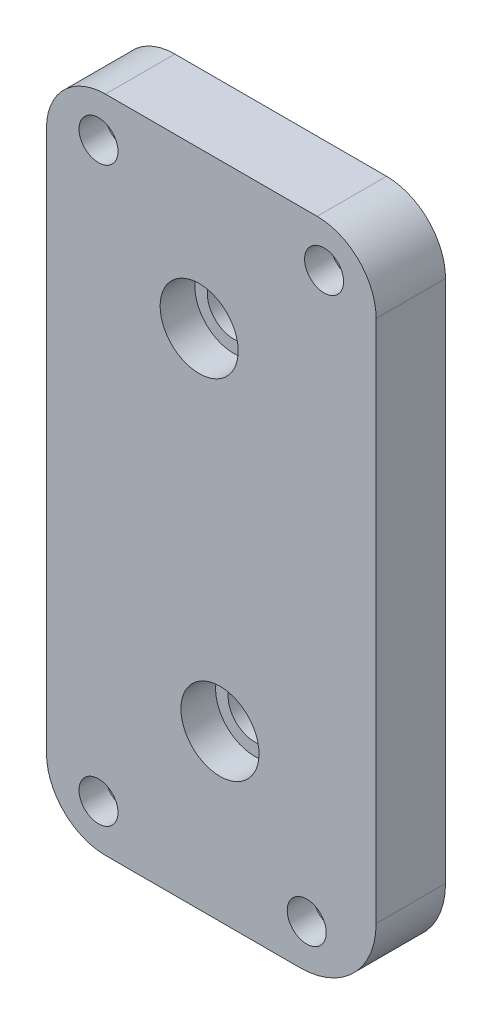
ISO-10303-21;
HEADER;
FILE_DESCRIPTION(('STEP AP214'),'2;1');
FILE_NAME('part.step','',(''),(''),'','','');
FILE_SCHEMA(('AUTOMOTIVE_DESIGN { 1 0 10303 214 1 1 1 1 }'));
ENDSEC;
DATA;
#1=APPLICATION_CONTEXT('core data for automotive mechanical design processes');
#2=APPLICATION_PROTOCOL_DEFINITION('international standard','automotive_design',2000,#1);
#3=PRODUCT_CONTEXT('',#1,'mechanical');
#4=PRODUCT('Part','Part','',(#3));
#5=PRODUCT_RELATED_PRODUCT_CATEGORY('part','',(#4));
#6=PRODUCT_DEFINITION_FORMATION('','',#4);
#7=PRODUCT_DEFINITION_CONTEXT('part definition',#1,'design');
#8=PRODUCT_DEFINITION('design','',#6,#7);
#9=PRODUCT_DEFINITION_SHAPE('','',#8);
#10=(LENGTH_UNIT() NAMED_UNIT(*) SI_UNIT(.MILLI.,.METRE.));
#11=(NAMED_UNIT(*) PLANE_ANGLE_UNIT() SI_UNIT($,.RADIAN.));
#12=(NAMED_UNIT(*) SI_UNIT($,.STERADIAN.) SOLID_ANGLE_UNIT());
#13=UNCERTAINTY_MEASURE_WITH_UNIT(LENGTH_MEASURE(1.E-05),#10,'distance_accuracy_value','');
#14=(GEOMETRIC_REPRESENTATION_CONTEXT(3) GLOBAL_UNCERTAINTY_ASSIGNED_CONTEXT((#13)) GLOBAL_UNIT_ASSIGNED_CONTEXT((#10,
#11,#12)) REPRESENTATION_CONTEXT('',''));
#15=CARTESIAN_POINT('',(0.,0.,0.));
#16=DIRECTION('',(0.,0.,1.));
#17=DIRECTION('',(1.,0.,0.));
#18=AXIS2_PLACEMENT_3D('',#15,#16,#17);
#19=CARTESIAN_POINT('',(-112.395,93.6752,12.7));
#20=DIRECTION('',(0.,0.,-1.));
#21=DIRECTION('',(-1.,0.,0.));
#22=AXIS2_PLACEMENT_3D('',#19,#20,#21);
#23=PLANE('',#22);
#24=CARTESIAN_POINT('',(-152.4,-8.24229999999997,12.7));
#25=DIRECTION('',(0.,0.,-1.));
#26=DIRECTION('',(-1.,0.,0.));
#27=AXIS2_PLACEMENT_3D('',#24,#25,#26);
#28=CIRCLE('',#27,3.56870000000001);
#29=CARTESIAN_POINT('',(-155.9687,-8.24229999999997,12.7));
#30=VERTEX_POINT('',#29);
#31=EDGE_CURVE('E358',#30,#30,#28,.T.);
#32=ORIENTED_EDGE('',*,*,#31,.T.);
#33=EDGE_LOOP('',(#32));
#34=FACE_BOUND('',#33,.T.);
#35=CARTESIAN_POINT('',(-111.125,96.5327,12.7));
#36=DIRECTION('',(0.,0.,-1.));
#37=DIRECTION('',(-1.,0.,0.));
#38=AXIS2_PLACEMENT_3D('',#35,#36,#37);
#39=CIRCLE('',#38,3.56869999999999);
#40=CARTESIAN_POINT('',(-114.6937,96.5327,12.7));
#41=VERTEX_POINT('',#40);
#42=EDGE_CURVE('E369',#41,#41,#39,.T.);
#43=ORIENTED_EDGE('',*,*,#42,.T.);
#44=EDGE_LOOP('',(#43));
#45=FACE_BOUND('',#44,.T.);
#46=CARTESIAN_POINT('',(-114.3,-8.24229999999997,12.7));
#47=DIRECTION('',(0.,0.,-1.));
#48=DIRECTION('',(-1.,0.,0.));
#49=AXIS2_PLACEMENT_3D('',#46,#47,#48);
#50=CIRCLE('',#49,3.56869999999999);
#51=CARTESIAN_POINT('',(-117.8687,-8.24229999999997,12.7));
#52=VERTEX_POINT('',#51);
#53=EDGE_CURVE('E379',#52,#52,#50,.T.);
#54=ORIENTED_EDGE('',*,*,#53,.T.);
#55=EDGE_LOOP('',(#54));
#56=FACE_BOUND('',#55,.T.);
#57=CARTESIAN_POINT('',(-152.4,96.5327,12.7));
#58=DIRECTION('',(0.,0.,-1.));
#59=DIRECTION('',(-1.,0.,0.));
#60=AXIS2_PLACEMENT_3D('',#57,#58,#59);
#61=CIRCLE('',#60,3.56870000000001);
#62=CARTESIAN_POINT('',(-155.9687,96.5327,12.7));
#63=VERTEX_POINT('',#62);
#64=EDGE_CURVE('E389',#63,#63,#61,.T.);
#65=ORIENTED_EDGE('',*,*,#64,.T.);
#66=EDGE_LOOP('',(#65));
#67=FACE_BOUND('',#66,.T.);
#68=CARTESIAN_POINT('',(-130.175,13.97,12.7));
#69=DIRECTION('',(0.,0.,-1.));
#70=DIRECTION('',(-1.,0.,0.));
#71=AXIS2_PLACEMENT_3D('',#68,#69,#70);
#72=CIRCLE('',#71,7.14375);
#73=CARTESIAN_POINT('',(-137.31875,13.97,12.7));
#74=VERTEX_POINT('',#73);
#75=EDGE_CURVE('E209',#74,#74,#72,.F.);
#76=ORIENTED_EDGE('',*,*,#75,.F.);
#77=EDGE_LOOP('',(#76));
#78=FACE_BOUND('',#77,.T.);
#79=CARTESIAN_POINT('',(-112.395,93.6752,12.7));
#80=DIRECTION('',(0.,0.,-1.));
#81=DIRECTION('',(-1.,0.,0.));
#82=AXIS2_PLACEMENT_3D('',#79,#80,#81);
#83=CIRCLE('',#82,10.795);
#84=CARTESIAN_POINT('',(-112.395,104.4702,12.7));
#85=VERTEX_POINT('',#84);
#86=CARTESIAN_POINT('',(-101.6,93.6752,12.7));
#87=VERTEX_POINT('',#86);
#88=EDGE_CURVE('E147',#85,#87,#83,.T.);
#89=ORIENTED_EDGE('',*,*,#88,.F.);
#90=DIRECTION('',(1.,0.,0.));
#91=VECTOR('',#90,1.);
#92=CARTESIAN_POINT('',(-151.13,104.4702,12.7));
#93=LINE('',#92,#91);
#94=CARTESIAN_POINT('',(-151.13,104.4702,12.7));
#95=VERTEX_POINT('',#94);
#96=EDGE_CURVE('E166',#95,#85,#93,.T.);
#97=ORIENTED_EDGE('',*,*,#96,.F.);
#98=CARTESIAN_POINT('',(-151.13,93.6752,12.7));
#99=DIRECTION('',(0.,0.,-1.));
#100=DIRECTION('',(-1.,0.,0.));
#101=AXIS2_PLACEMENT_3D('',#98,#99,#100);
#102=CIRCLE('',#101,10.795);
#103=CARTESIAN_POINT('',(-161.925,93.6752,12.7));
#104=VERTEX_POINT('',#103);
#105=EDGE_CURVE('E163',#104,#95,#102,.T.);
#106=ORIENTED_EDGE('',*,*,#105,.F.);
#107=DIRECTION('',(0.,1.,0.));
#108=VECTOR('',#107,1.);
#109=CARTESIAN_POINT('',(-161.925,-5.38479999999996,12.7));
#110=LINE('',#109,#108);
#111=CARTESIAN_POINT('',(-161.925,-5.38479999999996,12.7));
#112=VERTEX_POINT('',#111);
#113=EDGE_CURVE('E114',#112,#104,#110,.T.);
#114=ORIENTED_EDGE('',*,*,#113,.F.);
#115=CARTESIAN_POINT('',(-151.13,-5.38479999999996,12.7));
#116=DIRECTION('',(0.,0.,-1.));
#117=DIRECTION('',(-1.,0.,0.));
#118=AXIS2_PLACEMENT_3D('',#115,#116,#117);
#119=CIRCLE('',#118,10.795);
#120=CARTESIAN_POINT('',(-151.13,-16.1798,12.7));
#121=VERTEX_POINT('',#120);
#122=EDGE_CURVE('E158',#121,#112,#119,.T.);
#123=ORIENTED_EDGE('',*,*,#122,.F.);
#124=DIRECTION('',(-1.,0.,0.));
#125=VECTOR('',#124,1.);
#126=CARTESIAN_POINT('',(-115.57,-16.1798,12.7));
#127=LINE('',#126,#125);
#128=CARTESIAN_POINT('',(-115.57,-16.1798,12.7));
#129=VERTEX_POINT('',#128);
#130=EDGE_CURVE('E155',#129,#121,#127,.T.);
#131=ORIENTED_EDGE('',*,*,#130,.F.);
#132=CARTESIAN_POINT('',(-115.57,-2.20979999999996,12.7));
#133=DIRECTION('',(0.,0.,-1.));
#134=DIRECTION('',(-1.,0.,0.));
#135=AXIS2_PLACEMENT_3D('',#132,#133,#134);
#136=CIRCLE('',#135,13.97);
#137=CARTESIAN_POINT('',(-101.6,-2.20979999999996,12.7));
#138=VERTEX_POINT('',#137);
#139=EDGE_CURVE('E152',#138,#129,#136,.T.);
#140=ORIENTED_EDGE('',*,*,#139,.F.);
#141=DIRECTION('',(0.,-1.,0.));
#142=VECTOR('',#141,1.);
#143=CARTESIAN_POINT('',(-101.6,93.6752,12.7));
#144=LINE('',#143,#142);
#145=EDGE_CURVE('E60',#87,#138,#144,.T.);
#146=ORIENTED_EDGE('',*,*,#145,.F.);
#147=EDGE_LOOP('',(#89,#97,#106,#114,#123,#131,#140,#146));
#148=FACE_BOUND('',#147,.T.);
#149=CARTESIAN_POINT('',(-133.985,75.8952,12.7));
#150=DIRECTION('',(0.,0.,-1.));
#151=DIRECTION('',(-1.,0.,0.));
#152=AXIS2_PLACEMENT_3D('',#149,#150,#151);
#153=CIRCLE('',#152,7.14375);
#154=CARTESIAN_POINT('',(-141.12875,75.8952,12.7));
#155=VERTEX_POINT('',#154);
#156=EDGE_CURVE('E47',#155,#155,#153,.F.);
#157=ORIENTED_EDGE('',*,*,#156,.F.);
#158=EDGE_LOOP('',(#157));
#159=FACE_BOUND('',#158,.T.);
#160=ADVANCED_FACE('F43',(#34,#45,#56,#67,#78,#148,#159),#23,.F.);
#161=CARTESIAN_POINT('',(-112.395,93.6752,25.41));
#162=DIRECTION('',(0.,0.,-1.));
#163=DIRECTION('',(-1.,0.,0.));
#164=AXIS2_PLACEMENT_3D('',#161,#162,#163);
#165=CYLINDRICAL_SURFACE('',#164,10.795);
#166=DIRECTION('',(0.,0.,-1.));
#167=VECTOR('',#166,1.);
#168=CARTESIAN_POINT('',(-112.395,104.4702,25.41));
#169=LINE('',#168,#167);
#170=CARTESIAN_POINT('',(-112.395,104.4702,0.));
#171=VERTEX_POINT('',#170);
#172=EDGE_CURVE('E171',#85,#171,#169,.T.);
#173=ORIENTED_EDGE('',*,*,#172,.F.);
#174=ORIENTED_EDGE('',*,*,#88,.T.);
#175=DIRECTION('',(0.,0.,-1.));
#176=VECTOR('',#175,1.);
#177=CARTESIAN_POINT('',(-101.6,93.6752,25.41));
#178=LINE('',#177,#176);
#179=CARTESIAN_POINT('',(-101.6,93.6752,0.));
#180=VERTEX_POINT('',#179);
#181=EDGE_CURVE('E173',#87,#180,#178,.T.);
#182=ORIENTED_EDGE('',*,*,#181,.T.);
#183=CARTESIAN_POINT('',(-112.395,93.6752,0.));
#184=DIRECTION('',(0.,0.,1.));
#185=DIRECTION('',(1.,0.,0.));
#186=AXIS2_PLACEMENT_3D('',#183,#184,#185);
#187=CIRCLE('',#186,10.795);
#188=EDGE_CURVE('E142',#180,#171,#187,.T.);
#189=ORIENTED_EDGE('',*,*,#188,.T.);
#190=EDGE_LOOP('',(#173,#174,#182,#189));
#191=FACE_BOUND('',#190,.T.);
#192=ADVANCED_FACE('F220',(#191),#165,.T.);
#193=CARTESIAN_POINT('',(-101.6,93.6752,25.41));
#194=DIRECTION('',(1.,0.,0.));
#195=DIRECTION('',(0.,0.,-1.));
#196=AXIS2_PLACEMENT_3D('',#193,#194,#195);
#197=PLANE('',#196);
#198=ORIENTED_EDGE('',*,*,#181,.F.);
#199=ORIENTED_EDGE('',*,*,#145,.T.);
#200=DIRECTION('',(0.,0.,-1.));
#201=VECTOR('',#200,1.);
#202=CARTESIAN_POINT('',(-101.6,-2.20979999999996,25.41));
#203=LINE('',#202,#201);
#204=CARTESIAN_POINT('',(-101.6,-2.20979999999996,0.));
#205=VERTEX_POINT('',#204);
#206=EDGE_CURVE('E175',#138,#205,#203,.T.);
#207=ORIENTED_EDGE('',*,*,#206,.T.);
#208=DIRECTION('',(0.,1.,0.));
#209=VECTOR('',#208,1.);
#210=CARTESIAN_POINT('',(-101.6,0.,0.));
#211=LINE('',#210,#209);
#212=EDGE_CURVE('E139',#205,#180,#211,.T.);
#213=ORIENTED_EDGE('',*,*,#212,.T.);
#214=EDGE_LOOP('',(#198,#199,#207,#213));
#215=FACE_BOUND('',#214,.T.);
#216=ADVANCED_FACE('F228',(#215),#197,.T.);
#217=CARTESIAN_POINT('',(-115.57,-2.20979999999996,25.41));
#218=DIRECTION('',(0.,0.,-1.));
#219=DIRECTION('',(-1.,0.,0.));
#220=AXIS2_PLACEMENT_3D('',#217,#218,#219);
#221=CYLINDRICAL_SURFACE('',#220,13.97);
#222=ORIENTED_EDGE('',*,*,#206,.F.);
#223=ORIENTED_EDGE('',*,*,#139,.T.);
#224=DIRECTION('',(0.,0.,-1.));
#225=VECTOR('',#224,1.);
#226=CARTESIAN_POINT('',(-115.57,-16.1798,25.41));
#227=LINE('',#226,#225);
#228=CARTESIAN_POINT('',(-115.57,-16.1798,0.));
#229=VERTEX_POINT('',#228);
#230=EDGE_CURVE('E177',#129,#229,#227,.T.);
#231=ORIENTED_EDGE('',*,*,#230,.T.);
#232=CARTESIAN_POINT('',(-115.57,-2.20979999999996,0.));
#233=DIRECTION('',(0.,0.,1.));
#234=DIRECTION('',(1.,0.,0.));
#235=AXIS2_PLACEMENT_3D('',#232,#233,#234);
#236=CIRCLE('',#235,13.97);
#237=EDGE_CURVE('E134',#229,#205,#236,.T.);
#238=ORIENTED_EDGE('',*,*,#237,.T.);
#239=EDGE_LOOP('',(#222,#223,#231,#238));
#240=FACE_BOUND('',#239,.T.);
#241=ADVANCED_FACE('F247',(#240),#221,.T.);
#242=CARTESIAN_POINT('',(-115.57,-16.1798,25.41));
#243=DIRECTION('',(0.,-1.,0.));
#244=DIRECTION('',(0.,0.,-1.));
#245=AXIS2_PLACEMENT_3D('',#242,#243,#244);
#246=PLANE('',#245);
#247=ORIENTED_EDGE('',*,*,#230,.F.);
#248=ORIENTED_EDGE('',*,*,#130,.T.);
#249=DIRECTION('',(0.,0.,-1.));
#250=VECTOR('',#249,1.);
#251=CARTESIAN_POINT('',(-151.13,-16.1798,25.41));
#252=LINE('',#251,#250);
#253=CARTESIAN_POINT('',(-151.13,-16.1798,0.));
#254=VERTEX_POINT('',#253);
#255=EDGE_CURVE('E118',#121,#254,#252,.T.);
#256=ORIENTED_EDGE('',*,*,#255,.T.);
#257=DIRECTION('',(1.,0.,0.));
#258=VECTOR('',#257,1.);
#259=CARTESIAN_POINT('',(0.,-16.1798,0.));
#260=LINE('',#259,#258);
#261=EDGE_CURVE('E130',#254,#229,#260,.T.);
#262=ORIENTED_EDGE('',*,*,#261,.T.);
#263=EDGE_LOOP('',(#247,#248,#256,#262));
#264=FACE_BOUND('',#263,.T.);
#265=ADVANCED_FACE('F242',(#264),#246,.T.);
#266=CARTESIAN_POINT('',(-151.13,-5.38479999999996,25.41));
#267=DIRECTION('',(0.,0.,-1.));
#268=DIRECTION('',(-1.,0.,0.));
#269=AXIS2_PLACEMENT_3D('',#266,#267,#268);
#270=CYLINDRICAL_SURFACE('',#269,10.795);
#271=ORIENTED_EDGE('',*,*,#255,.F.);
#272=ORIENTED_EDGE('',*,*,#122,.T.);
#273=DIRECTION('',(0.,0.,-1.));
#274=VECTOR('',#273,1.);
#275=CARTESIAN_POINT('',(-161.925,-5.38479999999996,25.41));
#276=LINE('',#275,#274);
#277=CARTESIAN_POINT('',(-161.925,-5.38479999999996,0.));
#278=VERTEX_POINT('',#277);
#279=EDGE_CURVE('E119',#112,#278,#276,.T.);
#280=ORIENTED_EDGE('',*,*,#279,.T.);
#281=CARTESIAN_POINT('',(-151.13,-5.38479999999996,0.));
#282=DIRECTION('',(0.,0.,1.));
#283=DIRECTION('',(1.,0.,0.));
#284=AXIS2_PLACEMENT_3D('',#281,#282,#283);
#285=CIRCLE('',#284,10.795);
#286=EDGE_CURVE('E52',#278,#254,#285,.T.);
#287=ORIENTED_EDGE('',*,*,#286,.T.);
#288=EDGE_LOOP('',(#271,#272,#280,#287));
#289=FACE_BOUND('',#288,.T.);
#290=ADVANCED_FACE('F237',(#289),#270,.T.);
#291=CARTESIAN_POINT('',(-161.925,93.6752,25.41));
#292=DIRECTION('',(-1.,0.,0.));
#293=DIRECTION('',(0.,0.,1.));
#294=AXIS2_PLACEMENT_3D('',#291,#292,#293);
#295=PLANE('',#294);
#296=ORIENTED_EDGE('',*,*,#279,.F.);
#297=ORIENTED_EDGE('',*,*,#113,.T.);
#298=DIRECTION('',(0.,0.,-1.));
#299=VECTOR('',#298,1.);
#300=CARTESIAN_POINT('',(-161.925,93.6752,25.41));
#301=LINE('',#300,#299);
#302=CARTESIAN_POINT('',(-161.925,93.6752,0.));
#303=VERTEX_POINT('',#302);
#304=EDGE_CURVE('E108',#104,#303,#301,.T.);
#305=ORIENTED_EDGE('',*,*,#304,.T.);
#306=DIRECTION('',(0.,-1.,0.));
#307=VECTOR('',#306,1.);
#308=CARTESIAN_POINT('',(-161.925,0.,0.));
#309=LINE('',#308,#307);
#310=EDGE_CURVE('E11',#303,#278,#309,.T.);
#311=ORIENTED_EDGE('',*,*,#310,.T.);
#312=EDGE_LOOP('',(#296,#297,#305,#311));
#313=FACE_BOUND('',#312,.T.);
#314=ADVANCED_FACE('F111',(#313),#295,.T.);
#315=CARTESIAN_POINT('',(-151.13,93.6752,25.41));
#316=DIRECTION('',(0.,0.,-1.));
#317=DIRECTION('',(-1.,0.,0.));
#318=AXIS2_PLACEMENT_3D('',#315,#316,#317);
#319=CYLINDRICAL_SURFACE('',#318,10.795);
#320=ORIENTED_EDGE('',*,*,#304,.F.);
#321=ORIENTED_EDGE('',*,*,#105,.T.);
#322=DIRECTION('',(0.,0.,-1.));
#323=VECTOR('',#322,1.);
#324=CARTESIAN_POINT('',(-151.13,104.4702,25.41));
#325=LINE('',#324,#323);
#326=CARTESIAN_POINT('',(-151.13,104.4702,0.));
#327=VERTEX_POINT('',#326);
#328=EDGE_CURVE('E129',#95,#327,#325,.T.);
#329=ORIENTED_EDGE('',*,*,#328,.T.);
#330=CARTESIAN_POINT('',(-151.13,93.6752,0.));
#331=DIRECTION('',(0.,0.,1.));
#332=DIRECTION('',(1.,0.,0.));
#333=AXIS2_PLACEMENT_3D('',#330,#331,#332);
#334=CIRCLE('',#333,10.795);
#335=EDGE_CURVE('E124',#327,#303,#334,.T.);
#336=ORIENTED_EDGE('',*,*,#335,.T.);
#337=EDGE_LOOP('',(#320,#321,#329,#336));
#338=FACE_BOUND('',#337,.T.);
#339=ADVANCED_FACE('F45',(#338),#319,.T.);
#340=CARTESIAN_POINT('',(-112.395,104.4702,25.41));
#341=DIRECTION('',(0.,1.,0.));
#342=DIRECTION('',(0.,0.,1.));
#343=AXIS2_PLACEMENT_3D('',#340,#341,#342);
#344=PLANE('',#343);
#345=ORIENTED_EDGE('',*,*,#328,.F.);
#346=ORIENTED_EDGE('',*,*,#96,.T.);
#347=ORIENTED_EDGE('',*,*,#172,.T.);
#348=DIRECTION('',(-1.,0.,0.));
#349=VECTOR('',#348,1.);
#350=CARTESIAN_POINT('',(0.,104.4702,0.));
#351=LINE('',#350,#349);
#352=EDGE_CURVE('E145',#171,#327,#351,.T.);
#353=ORIENTED_EDGE('',*,*,#352,.T.);
#354=EDGE_LOOP('',(#345,#346,#347,#353));
#355=FACE_BOUND('',#354,.T.);
#356=ADVANCED_FACE('F231',(#355),#344,.T.);
#357=CARTESIAN_POINT('',(-130.175,13.97,25.4));
#358=DIRECTION('',(0.,0.,1.));
#359=DIRECTION('',(1.,0.,0.));
#360=AXIS2_PLACEMENT_3D('',#357,#358,#359);
#361=CYLINDRICAL_SURFACE('',#360,4.86791);
#362=CARTESIAN_POINT('',(-130.175,13.97,0.));
#363=DIRECTION('',(0.,0.,1.));
#364=DIRECTION('',(1.,0.,0.));
#365=AXIS2_PLACEMENT_3D('',#362,#363,#364);
#366=CIRCLE('',#365,4.86791);
#367=CARTESIAN_POINT('',(-125.30709,13.97,0.));
#368=VERTEX_POINT('',#367);
#369=EDGE_CURVE('E169',#368,#368,#366,.T.);
#370=ORIENTED_EDGE('',*,*,#369,.F.);
#371=EDGE_LOOP('',(#370));
#372=FACE_BOUND('',#371,.T.);
#373=CARTESIAN_POINT('',(-130.175,13.97,6.35));
#374=DIRECTION('',(0.,0.,1.));
#375=DIRECTION('',(1.,0.,0.));
#376=AXIS2_PLACEMENT_3D('',#373,#374,#375);
#377=CIRCLE('',#376,4.86791);
#378=CARTESIAN_POINT('',(-125.30709,13.97,6.35));
#379=VERTEX_POINT('',#378);
#380=EDGE_CURVE('E194',#379,#379,#377,.T.);
#381=ORIENTED_EDGE('',*,*,#380,.T.);
#382=EDGE_LOOP('',(#381));
#383=FACE_BOUND('',#382,.T.);
#384=ADVANCED_FACE('F254',(#372,#383),#361,.F.);
#385=CARTESIAN_POINT('',(-133.985,75.8952,25.4));
#386=DIRECTION('',(0.,0.,1.));
#387=DIRECTION('',(1.,0.,0.));
#388=AXIS2_PLACEMENT_3D('',#385,#386,#387);
#389=CYLINDRICAL_SURFACE('',#388,4.86791);
#390=CARTESIAN_POINT('',(-133.985,75.8952,0.));
#391=DIRECTION('',(0.,0.,1.));
#392=DIRECTION('',(1.,0.,0.));
#393=AXIS2_PLACEMENT_3D('',#390,#391,#392);
#394=CIRCLE('',#393,4.86791);
#395=CARTESIAN_POINT('',(-129.11709,75.8952,0.));
#396=VERTEX_POINT('',#395);
#397=EDGE_CURVE('E200',#396,#396,#394,.T.);
#398=ORIENTED_EDGE('',*,*,#397,.F.);
#399=EDGE_LOOP('',(#398));
#400=FACE_BOUND('',#399,.T.);
#401=CARTESIAN_POINT('',(-133.985,75.8952,6.35));
#402=DIRECTION('',(0.,0.,1.));
#403=DIRECTION('',(1.,0.,0.));
#404=AXIS2_PLACEMENT_3D('',#401,#402,#403);
#405=CIRCLE('',#404,4.86791);
#406=CARTESIAN_POINT('',(-129.11709,75.8952,6.35));
#407=VERTEX_POINT('',#406);
#408=EDGE_CURVE('E203',#407,#407,#405,.T.);
#409=ORIENTED_EDGE('',*,*,#408,.T.);
#410=EDGE_LOOP('',(#409));
#411=FACE_BOUND('',#410,.T.);
#412=ADVANCED_FACE('F260',(#400,#411),#389,.F.);
#413=CARTESIAN_POINT('',(0.,0.,0.));
#414=DIRECTION('',(0.,0.,1.));
#415=DIRECTION('',(1.,0.,0.));
#416=AXIS2_PLACEMENT_3D('',#413,#414,#415);
#417=PLANE('',#416);
#418=CARTESIAN_POINT('',(-152.4,-8.24229999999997,0.));
#419=DIRECTION('',(0.,0.,-1.));
#420=DIRECTION('',(-1.,0.,0.));
#421=AXIS2_PLACEMENT_3D('',#418,#419,#420);
#422=CIRCLE('',#421,5.35939999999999);
#423=CARTESIAN_POINT('',(-157.7594,-8.24229999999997,0.));
#424=VERTEX_POINT('',#423);
#425=EDGE_CURVE('E290',#424,#424,#422,.T.);
#426=ORIENTED_EDGE('',*,*,#425,.F.);
#427=EDGE_LOOP('',(#426));
#428=FACE_BOUND('',#427,.T.);
#429=CARTESIAN_POINT('',(-111.125,96.5327,0.));
#430=DIRECTION('',(0.,0.,-1.));
#431=DIRECTION('',(-1.,0.,0.));
#432=AXIS2_PLACEMENT_3D('',#429,#430,#431);
#433=CIRCLE('',#432,5.3594);
#434=CARTESIAN_POINT('',(-116.4844,96.5327,0.));
#435=VERTEX_POINT('',#434);
#436=EDGE_CURVE('E294',#435,#435,#433,.T.);
#437=ORIENTED_EDGE('',*,*,#436,.F.);
#438=EDGE_LOOP('',(#437));
#439=FACE_BOUND('',#438,.T.);
#440=CARTESIAN_POINT('',(-114.3,-8.24229999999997,0.));
#441=DIRECTION('',(0.,0.,-1.));
#442=DIRECTION('',(-1.,0.,0.));
#443=AXIS2_PLACEMENT_3D('',#440,#441,#442);
#444=CIRCLE('',#443,5.3594);
#445=CARTESIAN_POINT('',(-119.6594,-8.24229999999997,0.));
#446=VERTEX_POINT('',#445);
#447=EDGE_CURVE('E298',#446,#446,#444,.T.);
#448=ORIENTED_EDGE('',*,*,#447,.F.);
#449=EDGE_LOOP('',(#448));
#450=FACE_BOUND('',#449,.T.);
#451=CARTESIAN_POINT('',(-152.4,96.5327,0.));
#452=DIRECTION('',(0.,0.,-1.));
#453=DIRECTION('',(-1.,0.,0.));
#454=AXIS2_PLACEMENT_3D('',#451,#452,#453);
#455=CIRCLE('',#454,5.35939999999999);
#456=CARTESIAN_POINT('',(-157.7594,96.5327,0.));
#457=VERTEX_POINT('',#456);
#458=EDGE_CURVE('E180',#457,#457,#455,.T.);
#459=ORIENTED_EDGE('',*,*,#458,.F.);
#460=EDGE_LOOP('',(#459));
#461=FACE_BOUND('',#460,.T.);
#462=ORIENTED_EDGE('',*,*,#397,.T.);
#463=EDGE_LOOP('',(#462));
#464=FACE_BOUND('',#463,.T.);
#465=ORIENTED_EDGE('',*,*,#369,.T.);
#466=EDGE_LOOP('',(#465));
#467=FACE_BOUND('',#466,.T.);
#468=ORIENTED_EDGE('',*,*,#352,.F.);
#469=ORIENTED_EDGE('',*,*,#188,.F.);
#470=ORIENTED_EDGE('',*,*,#212,.F.);
#471=ORIENTED_EDGE('',*,*,#237,.F.);
#472=ORIENTED_EDGE('',*,*,#261,.F.);
#473=ORIENTED_EDGE('',*,*,#286,.F.);
#474=ORIENTED_EDGE('',*,*,#310,.F.);
#475=ORIENTED_EDGE('',*,*,#335,.F.);
#476=EDGE_LOOP('',(#468,#469,#470,#471,#472,#473,#474,#475));
#477=FACE_BOUND('',#476,.T.);
#478=ADVANCED_FACE('F123',(#428,#439,#450,#461,#464,#467,#477),#417,.F.);
#479=CARTESIAN_POINT('',(-125.30709,13.97,6.35));
#480=DIRECTION('',(0.,0.,-1.));
#481=DIRECTION('',(-1.,0.,0.));
#482=AXIS2_PLACEMENT_3D('',#479,#480,#481);
#483=PLANE('',#482);
#484=ORIENTED_EDGE('',*,*,#380,.F.);
#485=EDGE_LOOP('',(#484));
#486=FACE_BOUND('',#485,.T.);
#487=CARTESIAN_POINT('',(-130.175,13.97,6.35));
#488=DIRECTION('',(0.,0.,1.));
#489=DIRECTION('',(1.,0.,0.));
#490=AXIS2_PLACEMENT_3D('',#487,#488,#489);
#491=CIRCLE('',#490,7.14375);
#492=CARTESIAN_POINT('',(-123.03125,13.97,6.35));
#493=VERTEX_POINT('',#492);
#494=EDGE_CURVE('E197',#493,#493,#491,.T.);
#495=ORIENTED_EDGE('',*,*,#494,.T.);
#496=EDGE_LOOP('',(#495));
#497=FACE_BOUND('',#496,.T.);
#498=ADVANCED_FACE('F277',(#486,#497),#483,.F.);
#499=CARTESIAN_POINT('',(-130.175,13.97,25.4));
#500=DIRECTION('',(0.,0.,1.));
#501=DIRECTION('',(1.,0.,0.));
#502=AXIS2_PLACEMENT_3D('',#499,#500,#501);
#503=CYLINDRICAL_SURFACE('',#502,7.14375);
#504=ORIENTED_EDGE('',*,*,#75,.T.);
#505=EDGE_LOOP('',(#504));
#506=FACE_BOUND('',#505,.T.);
#507=ORIENTED_EDGE('',*,*,#494,.F.);
#508=EDGE_LOOP('',(#507));
#509=FACE_BOUND('',#508,.T.);
#510=ADVANCED_FACE('F273',(#506,#509),#503,.F.);
#511=CARTESIAN_POINT('',(-129.11709,75.8952,6.35));
#512=DIRECTION('',(0.,0.,-1.));
#513=DIRECTION('',(-1.,0.,0.));
#514=AXIS2_PLACEMENT_3D('',#511,#512,#513);
#515=PLANE('',#514);
#516=ORIENTED_EDGE('',*,*,#408,.F.);
#517=EDGE_LOOP('',(#516));
#518=FACE_BOUND('',#517,.T.);
#519=CARTESIAN_POINT('',(-133.985,75.8952,6.35));
#520=DIRECTION('',(0.,0.,1.));
#521=DIRECTION('',(1.,0.,0.));
#522=AXIS2_PLACEMENT_3D('',#519,#520,#521);
#523=CIRCLE('',#522,7.14375);
#524=CARTESIAN_POINT('',(-126.84125,75.8952,6.35));
#525=VERTEX_POINT('',#524);
#526=EDGE_CURVE('E206',#525,#525,#523,.T.);
#527=ORIENTED_EDGE('',*,*,#526,.T.);
#528=EDGE_LOOP('',(#527));
#529=FACE_BOUND('',#528,.T.);
#530=ADVANCED_FACE('F264',(#518,#529),#515,.F.);
#531=CARTESIAN_POINT('',(-133.985,75.8952,25.4));
#532=DIRECTION('',(0.,0.,1.));
#533=DIRECTION('',(1.,0.,0.));
#534=AXIS2_PLACEMENT_3D('',#531,#532,#533);
#535=CYLINDRICAL_SURFACE('',#534,7.14375);
#536=ORIENTED_EDGE('',*,*,#156,.T.);
#537=EDGE_LOOP('',(#536));
#538=FACE_BOUND('',#537,.T.);
#539=ORIENTED_EDGE('',*,*,#526,.F.);
#540=EDGE_LOOP('',(#539));
#541=FACE_BOUND('',#540,.T.);
#542=ADVANCED_FACE('F216',(#538,#541),#535,.F.);
#543=CARTESIAN_POINT('',(-152.4,96.5327,0.));
#544=DIRECTION('',(0.,0.,-1.));
#545=DIRECTION('',(-1.,0.,0.));
#546=AXIS2_PLACEMENT_3D('',#543,#544,#545);
#547=CYLINDRICAL_SURFACE('',#546,5.35939999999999);
#548=CARTESIAN_POINT('',(-152.4,96.5327,7.874));
#549=DIRECTION('',(0.,0.,-1.));
#550=DIRECTION('',(-1.,0.,0.));
#551=AXIS2_PLACEMENT_3D('',#548,#549,#550);
#552=CIRCLE('',#551,5.35939999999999);
#553=CARTESIAN_POINT('',(-157.7594,96.5327,7.874));
#554=VERTEX_POINT('',#553);
#555=EDGE_CURVE('E183',#554,#554,#552,.T.);
#556=ORIENTED_EDGE('',*,*,#555,.F.);
#557=EDGE_LOOP('',(#556));
#558=FACE_BOUND('',#557,.T.);
#559=ORIENTED_EDGE('',*,*,#458,.T.);
#560=EDGE_LOOP('',(#559));
#561=FACE_BOUND('',#560,.T.);
#562=ADVANCED_FACE('F263',(#558,#561),#547,.F.);
#563=CARTESIAN_POINT('',(-148.8313,96.5327,7.874));
#564=DIRECTION('',(0.,0.,1.));
#565=DIRECTION('',(1.,0.,0.));
#566=AXIS2_PLACEMENT_3D('',#563,#564,#565);
#567=PLANE('',#566);
#568=CARTESIAN_POINT('',(-152.4,96.5327,7.874));
#569=DIRECTION('',(0.,0.,-1.));
#570=DIRECTION('',(-1.,0.,0.));
#571=AXIS2_PLACEMENT_3D('',#568,#569,#570);
#572=CIRCLE('',#571,3.56870000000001);
#573=CARTESIAN_POINT('',(-155.9687,96.5327,7.874));
#574=VERTEX_POINT('',#573);
#575=EDGE_CURVE('E188',#574,#574,#572,.T.);
#576=ORIENTED_EDGE('',*,*,#575,.F.);
#577=EDGE_LOOP('',(#576));
#578=FACE_BOUND('',#577,.T.);
#579=ORIENTED_EDGE('',*,*,#555,.T.);
#580=EDGE_LOOP('',(#579));
#581=FACE_BOUND('',#580,.T.);
#582=ADVANCED_FACE('F269',(#578,#581),#567,.F.);
#583=CARTESIAN_POINT('',(-152.4,96.5327,0.));
#584=DIRECTION('',(0.,0.,-1.));
#585=DIRECTION('',(-1.,0.,0.));
#586=AXIS2_PLACEMENT_3D('',#583,#584,#585);
#587=CYLINDRICAL_SURFACE('',#586,3.56870000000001);
#588=ORIENTED_EDGE('',*,*,#64,.F.);
#589=EDGE_LOOP('',(#588));
#590=FACE_BOUND('',#589,.T.);
#591=ORIENTED_EDGE('',*,*,#575,.T.);
#592=EDGE_LOOP('',(#591));
#593=FACE_BOUND('',#592,.T.);
#594=ADVANCED_FACE('F314',(#590,#593),#587,.F.);
#595=CARTESIAN_POINT('',(-114.3,-8.24229999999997,0.));
#596=DIRECTION('',(0.,0.,-1.));
#597=DIRECTION('',(-1.,0.,0.));
#598=AXIS2_PLACEMENT_3D('',#595,#596,#597);
#599=CYLINDRICAL_SURFACE('',#598,5.3594);
#600=CARTESIAN_POINT('',(-114.3,-8.24229999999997,7.874));
#601=DIRECTION('',(0.,0.,-1.));
#602=DIRECTION('',(-1.,0.,0.));
#603=AXIS2_PLACEMENT_3D('',#600,#601,#602);
#604=CIRCLE('',#603,5.3594);
#605=CARTESIAN_POINT('',(-119.6594,-8.24229999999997,7.874));
#606=VERTEX_POINT('',#605);
#607=EDGE_CURVE('E385',#606,#606,#604,.T.);
#608=ORIENTED_EDGE('',*,*,#607,.F.);
#609=EDGE_LOOP('',(#608));
#610=FACE_BOUND('',#609,.T.);
#611=ORIENTED_EDGE('',*,*,#447,.T.);
#612=EDGE_LOOP('',(#611));
#613=FACE_BOUND('',#612,.T.);
#614=ADVANCED_FACE('F318',(#610,#613),#599,.F.);
#615=CARTESIAN_POINT('',(-110.7313,-8.24229999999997,7.874));
#616=DIRECTION('',(0.,0.,1.));
#617=DIRECTION('',(1.,0.,0.));
#618=AXIS2_PLACEMENT_3D('',#615,#616,#617);
#619=PLANE('',#618);
#620=CARTESIAN_POINT('',(-114.3,-8.24229999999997,7.874));
#621=DIRECTION('',(0.,0.,-1.));
#622=DIRECTION('',(-1.,0.,0.));
#623=AXIS2_PLACEMENT_3D('',#620,#621,#622);
#624=CIRCLE('',#623,3.56869999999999);
#625=CARTESIAN_POINT('',(-117.8687,-8.24229999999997,7.874));
#626=VERTEX_POINT('',#625);
#627=EDGE_CURVE('E382',#626,#626,#624,.T.);
#628=ORIENTED_EDGE('',*,*,#627,.F.);
#629=EDGE_LOOP('',(#628));
#630=FACE_BOUND('',#629,.T.);
#631=ORIENTED_EDGE('',*,*,#607,.T.);
#632=EDGE_LOOP('',(#631));
#633=FACE_BOUND('',#632,.T.);
#634=ADVANCED_FACE('F322',(#630,#633),#619,.F.);
#635=CARTESIAN_POINT('',(-114.3,-8.24229999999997,0.));
#636=DIRECTION('',(0.,0.,-1.));
#637=DIRECTION('',(-1.,0.,0.));
#638=AXIS2_PLACEMENT_3D('',#635,#636,#637);
#639=CYLINDRICAL_SURFACE('',#638,3.56869999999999);
#640=ORIENTED_EDGE('',*,*,#53,.F.);
#641=EDGE_LOOP('',(#640));
#642=FACE_BOUND('',#641,.T.);
#643=ORIENTED_EDGE('',*,*,#627,.T.);
#644=EDGE_LOOP('',(#643));
#645=FACE_BOUND('',#644,.T.);
#646=ADVANCED_FACE('F326',(#642,#645),#639,.F.);
#647=CARTESIAN_POINT('',(-111.125,96.5327,0.));
#648=DIRECTION('',(0.,0.,-1.));
#649=DIRECTION('',(-1.,0.,0.));
#650=AXIS2_PLACEMENT_3D('',#647,#648,#649);
#651=CYLINDRICAL_SURFACE('',#650,5.3594);
#652=CARTESIAN_POINT('',(-111.125,96.5327,7.874));
#653=DIRECTION('',(0.,0.,-1.));
#654=DIRECTION('',(-1.,0.,0.));
#655=AXIS2_PLACEMENT_3D('',#652,#653,#654);
#656=CIRCLE('',#655,5.3594);
#657=CARTESIAN_POINT('',(-116.4844,96.5327,7.874));
#658=VERTEX_POINT('',#657);
#659=EDGE_CURVE('E375',#658,#658,#656,.T.);
#660=ORIENTED_EDGE('',*,*,#659,.F.);
#661=EDGE_LOOP('',(#660));
#662=FACE_BOUND('',#661,.T.);
#663=ORIENTED_EDGE('',*,*,#436,.T.);
#664=EDGE_LOOP('',(#663));
#665=FACE_BOUND('',#664,.T.);
#666=ADVANCED_FACE('F330',(#662,#665),#651,.F.);
#667=CARTESIAN_POINT('',(-107.5563,96.5327,7.874));
#668=DIRECTION('',(0.,0.,1.));
#669=DIRECTION('',(1.,0.,0.));
#670=AXIS2_PLACEMENT_3D('',#667,#668,#669);
#671=PLANE('',#670);
#672=CARTESIAN_POINT('',(-111.125,96.5327,7.874));
#673=DIRECTION('',(0.,0.,-1.));
#674=DIRECTION('',(-1.,0.,0.));
#675=AXIS2_PLACEMENT_3D('',#672,#673,#674);
#676=CIRCLE('',#675,3.56869999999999);
#677=CARTESIAN_POINT('',(-114.6937,96.5327,7.874));
#678=VERTEX_POINT('',#677);
#679=EDGE_CURVE('E372',#678,#678,#676,.T.);
#680=ORIENTED_EDGE('',*,*,#679,.F.);
#681=EDGE_LOOP('',(#680));
#682=FACE_BOUND('',#681,.T.);
#683=ORIENTED_EDGE('',*,*,#659,.T.);
#684=EDGE_LOOP('',(#683));
#685=FACE_BOUND('',#684,.T.);
#686=ADVANCED_FACE('F334',(#682,#685),#671,.F.);
#687=CARTESIAN_POINT('',(-111.125,96.5327,0.));
#688=DIRECTION('',(0.,0.,-1.));
#689=DIRECTION('',(-1.,0.,0.));
#690=AXIS2_PLACEMENT_3D('',#687,#688,#689);
#691=CYLINDRICAL_SURFACE('',#690,3.56869999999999);
#692=ORIENTED_EDGE('',*,*,#42,.F.);
#693=EDGE_LOOP('',(#692));
#694=FACE_BOUND('',#693,.T.);
#695=ORIENTED_EDGE('',*,*,#679,.T.);
#696=EDGE_LOOP('',(#695));
#697=FACE_BOUND('',#696,.T.);
#698=ADVANCED_FACE('F338',(#694,#697),#691,.F.);
#699=CARTESIAN_POINT('',(-152.4,-8.24229999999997,0.));
#700=DIRECTION('',(0.,0.,-1.));
#701=DIRECTION('',(-1.,0.,0.));
#702=AXIS2_PLACEMENT_3D('',#699,#700,#701);
#703=CYLINDRICAL_SURFACE('',#702,5.35939999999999);
#704=CARTESIAN_POINT('',(-152.4,-8.24229999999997,7.874));
#705=DIRECTION('',(0.,0.,-1.));
#706=DIRECTION('',(-1.,0.,0.));
#707=AXIS2_PLACEMENT_3D('',#704,#705,#706);
#708=CIRCLE('',#707,5.35939999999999);
#709=CARTESIAN_POINT('',(-157.7594,-8.24229999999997,7.874));
#710=VERTEX_POINT('',#709);
#711=EDGE_CURVE('E362',#710,#710,#708,.T.);
#712=ORIENTED_EDGE('',*,*,#711,.F.);
#713=EDGE_LOOP('',(#712));
#714=FACE_BOUND('',#713,.T.);
#715=ORIENTED_EDGE('',*,*,#425,.T.);
#716=EDGE_LOOP('',(#715));
#717=FACE_BOUND('',#716,.T.);
#718=ADVANCED_FACE('F342',(#714,#717),#703,.F.);
#719=CARTESIAN_POINT('',(-148.8313,-8.24229999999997,7.874));
#720=DIRECTION('',(0.,0.,1.));
#721=DIRECTION('',(1.,0.,0.));
#722=AXIS2_PLACEMENT_3D('',#719,#720,#721);
#723=PLANE('',#722);
#724=CARTESIAN_POINT('',(-152.4,-8.24229999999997,7.874));
#725=DIRECTION('',(0.,0.,-1.));
#726=DIRECTION('',(-1.,0.,0.));
#727=AXIS2_PLACEMENT_3D('',#724,#725,#726);
#728=CIRCLE('',#727,3.56870000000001);
#729=CARTESIAN_POINT('',(-155.9687,-8.24229999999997,7.874));
#730=VERTEX_POINT('',#729);
#731=EDGE_CURVE('E361',#730,#730,#728,.T.);
#732=ORIENTED_EDGE('',*,*,#731,.F.);
#733=EDGE_LOOP('',(#732));
#734=FACE_BOUND('',#733,.T.);
#735=ORIENTED_EDGE('',*,*,#711,.T.);
#736=EDGE_LOOP('',(#735));
#737=FACE_BOUND('',#736,.T.);
#738=ADVANCED_FACE('F346',(#734,#737),#723,.F.);
#739=CARTESIAN_POINT('',(-152.4,-8.24229999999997,0.));
#740=DIRECTION('',(0.,0.,-1.));
#741=DIRECTION('',(-1.,0.,0.));
#742=AXIS2_PLACEMENT_3D('',#739,#740,#741);
#743=CYLINDRICAL_SURFACE('',#742,3.56870000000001);
#744=ORIENTED_EDGE('',*,*,#31,.F.);
#745=EDGE_LOOP('',(#744));
#746=FACE_BOUND('',#745,.T.);
#747=ORIENTED_EDGE('',*,*,#731,.T.);
#748=EDGE_LOOP('',(#747));
#749=FACE_BOUND('',#748,.T.);
#750=ADVANCED_FACE('F350',(#746,#749),#743,.F.);
#751=CLOSED_SHELL('',(#160,#192,#216,#241,#265,#290,#314,#339,#356,#384,#412,#478,#498,#510,
#530,#542,#562,#582,#594,#614,#634,#646,#666,#686,#698,#718,#738,#750));
#752=MANIFOLD_SOLID_BREP('B2',#751);
#753=ADVANCED_BREP_SHAPE_REPRESENTATION('',(#18,#752),#14);
#754=SHAPE_DEFINITION_REPRESENTATION(#9,#753);
ENDSEC;
END-ISO-10303-21;
